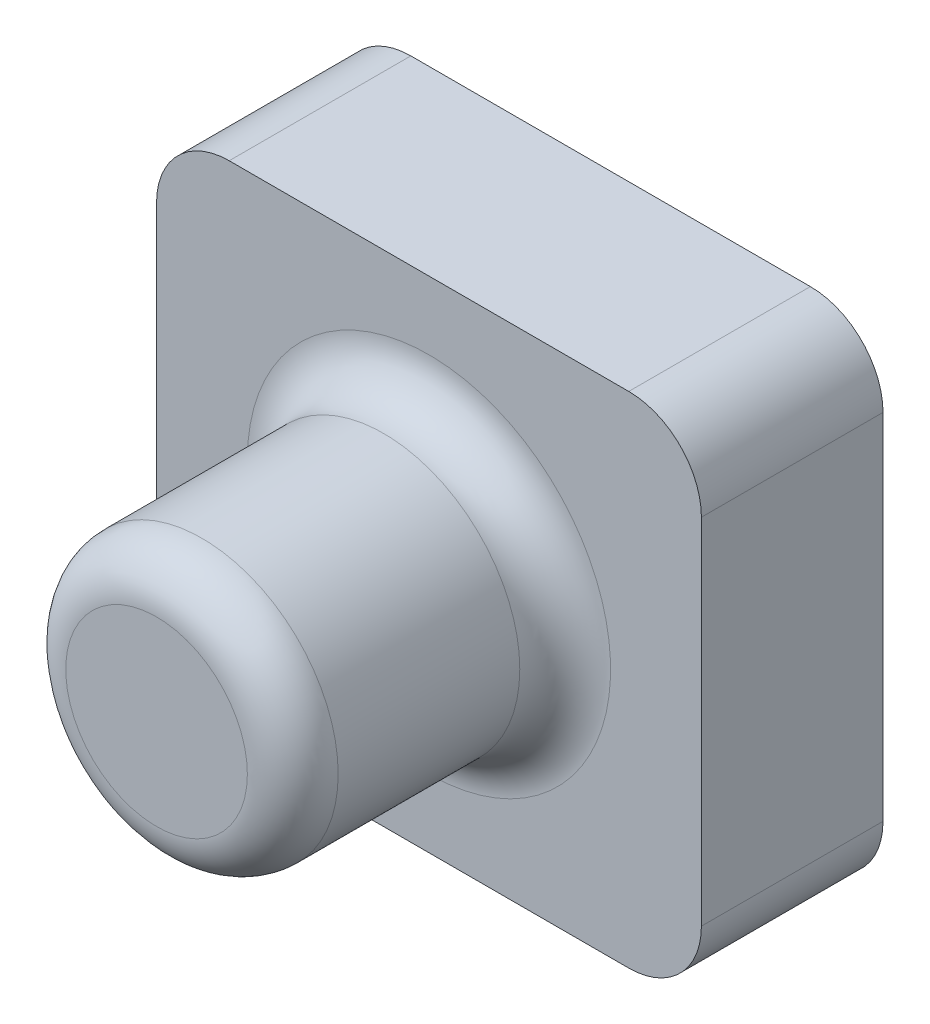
from build123d import *

# Parameters (mm, degrees)
SKETCH1_W           = 60
SKETCH1_H           = 55
MAIN_BODY_DEPTH     = 20
MAIN_BODY_FILLET_R  = 8
SKETCH2_R           = 15
ROUND_BOSS_DEPTH    = 30
ROUND_BOSS_FILLET_R = 5
SHELL1_T            = -3


with BuildPart() as part:
    # Sketch1 → Main Body (new body)
    with BuildSketch(Plane.XY):
        with Locations((30, 27.5)):
            Rectangle(SKETCH1_W, SKETCH1_H)
    extrude(amount=MAIN_BODY_DEPTH)

    # Main Body Fillet
    main_body_fillet_edges = [part.edges().sort_by_distance(p)[0] for p in [
        (0, 55, 10),
        (60, 55, 10),
        (60, 0, 10),
        (0, 0, 10),
    ]]
    fillet(main_body_fillet_edges, radius=MAIN_BODY_FILLET_R)

    # Sketch2 → Round Boss (add)
    with BuildSketch(Plane.XY.offset(20)):
        with Locations(Location((30, 27.5, 0), (0, 0, 180))):
            Circle(SKETCH2_R)
    extrude(amount=ROUND_BOSS_DEPTH)

    # Round Boss Fillet
    round_boss_fillet_edges = [part.edges().sort_by_distance(p)[0] for p in [
        (45, 27.5, 20),
        (45, 27.5, 50),
    ]]
    fillet(round_boss_fillet_edges, radius=ROUND_BOSS_FILLET_R)

    # Shell1
    shell1_openings = [part.faces().sort_by_distance(p)[0] for p in [
        (30, 27.5, 0),
    ]]
    offset(amount=SHELL1_T, openings=shell1_openings, kind=Kind.INTERSECTION)


solid = part.part
